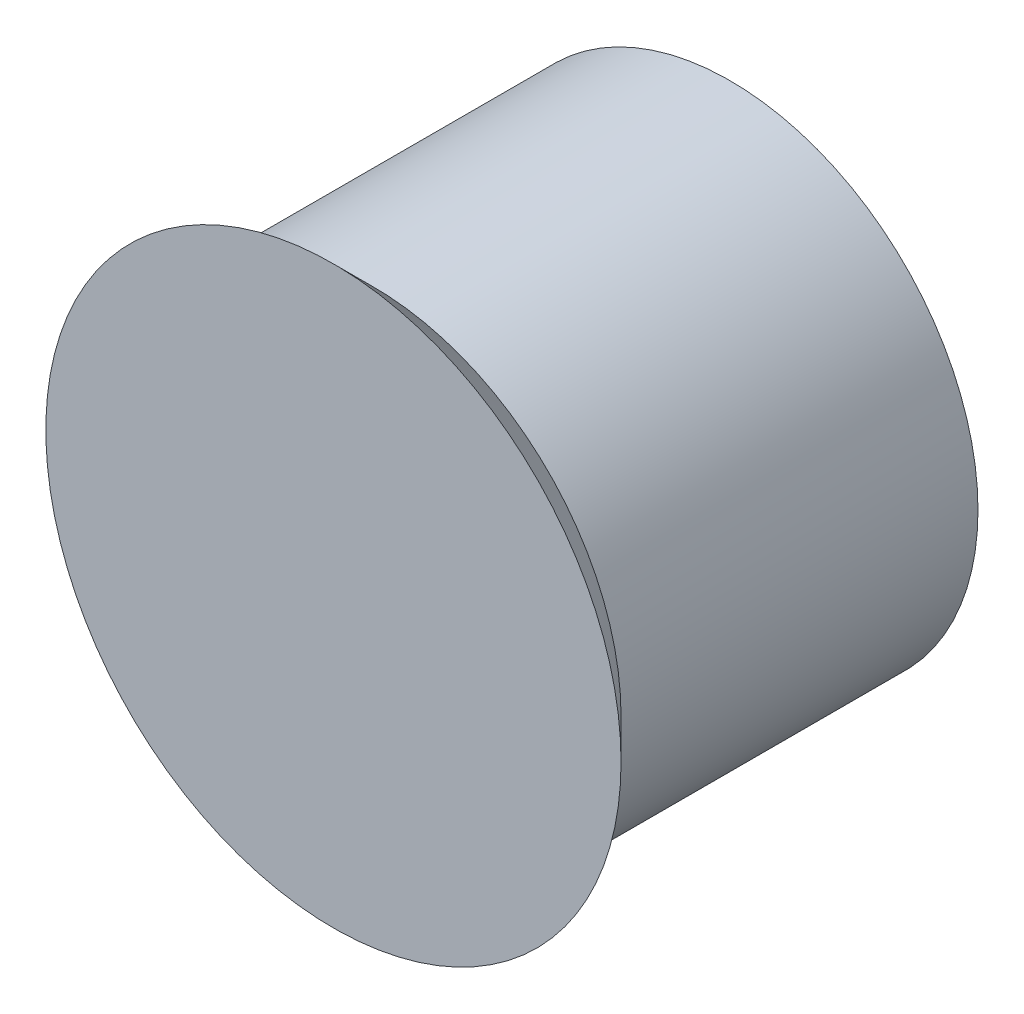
ISO-10303-21;
HEADER;
FILE_DESCRIPTION(('STEP AP214'),'2;1');
FILE_NAME('part.step','',(''),(''),'','','');
FILE_SCHEMA(('AUTOMOTIVE_DESIGN { 1 0 10303 214 1 1 1 1 }'));
ENDSEC;
DATA;
#1=APPLICATION_CONTEXT('core data for automotive mechanical design processes');
#2=APPLICATION_PROTOCOL_DEFINITION('international standard','automotive_design',2000,#1);
#3=PRODUCT_CONTEXT('',#1,'mechanical');
#4=PRODUCT('Part','Part','',(#3));
#5=PRODUCT_RELATED_PRODUCT_CATEGORY('part','',(#4));
#6=PRODUCT_DEFINITION_FORMATION('','',#4);
#7=PRODUCT_DEFINITION_CONTEXT('part definition',#1,'design');
#8=PRODUCT_DEFINITION('design','',#6,#7);
#9=PRODUCT_DEFINITION_SHAPE('','',#8);
#10=(LENGTH_UNIT() NAMED_UNIT(*) SI_UNIT(.MILLI.,.METRE.));
#11=(NAMED_UNIT(*) PLANE_ANGLE_UNIT() SI_UNIT($,.RADIAN.));
#12=(NAMED_UNIT(*) SI_UNIT($,.STERADIAN.) SOLID_ANGLE_UNIT());
#13=UNCERTAINTY_MEASURE_WITH_UNIT(LENGTH_MEASURE(1.E-05),#10,'distance_accuracy_value','');
#14=(GEOMETRIC_REPRESENTATION_CONTEXT(3) GLOBAL_UNCERTAINTY_ASSIGNED_CONTEXT((#13)) GLOBAL_UNIT_ASSIGNED_CONTEXT((#10,
#11,#12)) REPRESENTATION_CONTEXT('',''));
#15=CARTESIAN_POINT('',(0.,0.,0.));
#16=DIRECTION('',(0.,0.,1.));
#17=DIRECTION('',(1.,0.,0.));
#18=AXIS2_PLACEMENT_3D('',#15,#16,#17);
#19=CARTESIAN_POINT('',(0.,0.,1.8));
#20=DIRECTION('',(0.,0.,-1.));
#21=DIRECTION('',(-1.,0.,0.));
#22=AXIS2_PLACEMENT_3D('',#19,#20,#21);
#23=CYLINDRICAL_SURFACE('',#22,1.25);
#24=CARTESIAN_POINT('',(0.,0.,1.8));
#25=DIRECTION('',(0.,0.,1.));
#26=DIRECTION('',(1.,0.,0.));
#27=AXIS2_PLACEMENT_3D('',#24,#25,#26);
#28=CIRCLE('',#27,1.25023576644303);
#29=CARTESIAN_POINT('',(1.25023576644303,0.,1.8));
#30=VERTEX_POINT('',#29);
#31=EDGE_CURVE('E10',#30,#30,#28,.T.);
#32=ORIENTED_EDGE('',*,*,#31,.F.);
#33=EDGE_LOOP('',(#32));
#34=FACE_BOUND('',#33,.T.);
#35=CARTESIAN_POINT('',(0.,0.,0.));
#36=DIRECTION('',(0.,0.,1.));
#37=DIRECTION('',(1.,0.,0.));
#38=AXIS2_PLACEMENT_3D('',#35,#36,#37);
#39=CIRCLE('',#38,1.25);
#40=CARTESIAN_POINT('',(1.25,0.,0.));
#41=VERTEX_POINT('',#40);
#42=EDGE_CURVE('E47',#41,#41,#39,.T.);
#43=ORIENTED_EDGE('',*,*,#42,.T.);
#44=EDGE_LOOP('',(#43));
#45=FACE_BOUND('',#44,.T.);
#46=ADVANCED_FACE('F37',(#34,#45),#23,.T.);
#47=CARTESIAN_POINT('',(0.,0.,0.));
#48=DIRECTION('',(0.,0.,1.));
#49=DIRECTION('',(1.,0.,0.));
#50=AXIS2_PLACEMENT_3D('',#47,#48,#49);
#51=PLANE('',#50);
#52=ORIENTED_EDGE('',*,*,#42,.F.);
#53=EDGE_LOOP('',(#52));
#54=FACE_BOUND('',#53,.T.);
#55=ADVANCED_FACE('F66',(#54),#51,.F.);
#56=CARTESIAN_POINT('',(0.,0.,1.8));
#57=DIRECTION('',(0.,0.,1.));
#58=DIRECTION('',(1.,0.,0.));
#59=AXIS2_PLACEMENT_3D('',#56,#57,#58);
#60=CONICAL_SURFACE('',#59,1.25023576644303,0.78539816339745);
#61=CARTESIAN_POINT('',(0.,0.,2.));
#62=DIRECTION('',(0.,0.,1.));
#63=DIRECTION('',(1.,0.,0.));
#64=AXIS2_PLACEMENT_3D('',#61,#62,#63);
#65=CIRCLE('',#64,1.45023576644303);
#66=CARTESIAN_POINT('',(1.45023576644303,0.,2.));
#67=VERTEX_POINT('',#66);
#68=EDGE_CURVE('E53',#67,#67,#65,.T.);
#69=ORIENTED_EDGE('',*,*,#68,.F.);
#70=EDGE_LOOP('',(#69));
#71=FACE_BOUND('',#70,.T.);
#72=ORIENTED_EDGE('',*,*,#31,.T.);
#73=EDGE_LOOP('',(#72));
#74=FACE_BOUND('',#73,.T.);
#75=ADVANCED_FACE('F70',(#71,#74),#60,.T.);
#76=CARTESIAN_POINT('',(0.,0.,2.));
#77=DIRECTION('',(0.,0.,1.));
#78=DIRECTION('',(1.,0.,0.));
#79=AXIS2_PLACEMENT_3D('',#76,#77,#78);
#80=PLANE('',#79);
#81=ORIENTED_EDGE('',*,*,#68,.T.);
#82=EDGE_LOOP('',(#81));
#83=FACE_BOUND('',#82,.T.);
#84=ADVANCED_FACE('F75',(#83),#80,.T.);
#85=CLOSED_SHELL('',(#46,#55,#75,#84));
#86=MANIFOLD_SOLID_BREP('B2',#85);
#87=ADVANCED_BREP_SHAPE_REPRESENTATION('',(#18,#86),#14);
#88=SHAPE_DEFINITION_REPRESENTATION(#9,#87);
ENDSEC;
END-ISO-10303-21;
